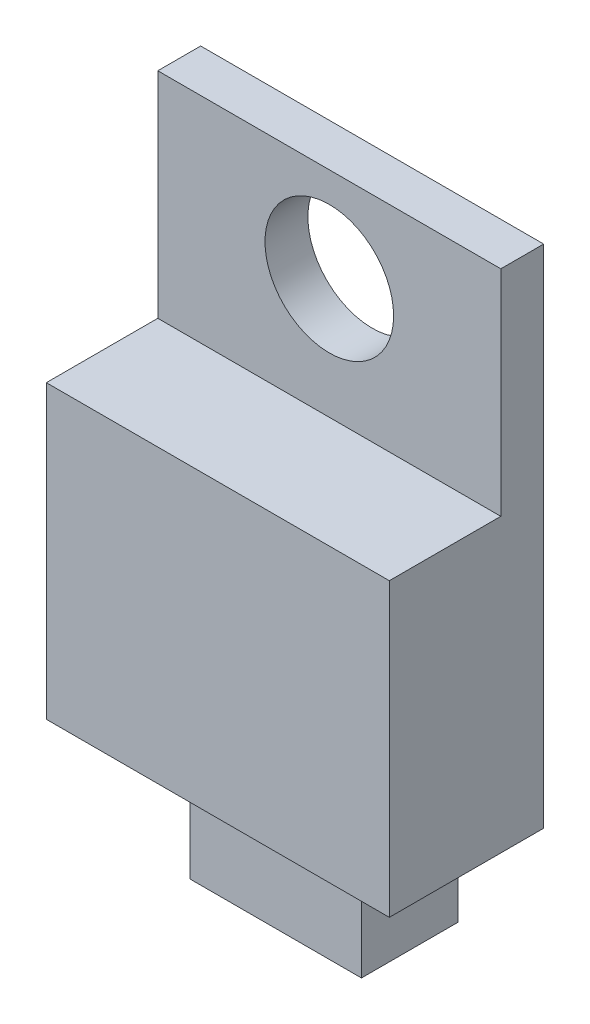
from build123d import *

# Parameters (mm, degrees)
SKETCH1_W      = 10.16
SKETCH1_H      = 14.986
SKETCH1_R      = 1.905
EXTRUDE1_DEPTH = 1.27
SKETCH2_W      = 10.16
SKETCH2_H      = 8.636
EXTRUDE2_DEPTH = 3.302
SKETCH3_W      = 5.08
SKETCH3_H      = 2.8575
EXTRUDE3_DEPTH = 3.683


with BuildPart() as part:
    # Sketch1 → Extrude1 (new body)
    with BuildSketch(Plane.XY):
        with Locations((5.08, 7.493)):
            Rectangle(SKETCH1_W, SKETCH1_H)
        with Locations((5.08, 12.192)):
            Circle(SKETCH1_R, mode=Mode.SUBTRACT)
    extrude(amount=EXTRUDE1_DEPTH)

    # Sketch2 → Extrude2 (add)
    with BuildSketch(Plane.XY.offset(1.27)):
        with Locations((5.08, 4.318)):
            Rectangle(SKETCH2_W, SKETCH2_H)
    extrude(amount=EXTRUDE2_DEPTH)

    # Sketch3 → Extrude3 (add)
    with BuildSketch(Plane.XZ):
        with Locations((5.08, 1.42875)):
            Rectangle(SKETCH3_W, SKETCH3_H)
    extrude(amount=EXTRUDE3_DEPTH)


solid = part.part
